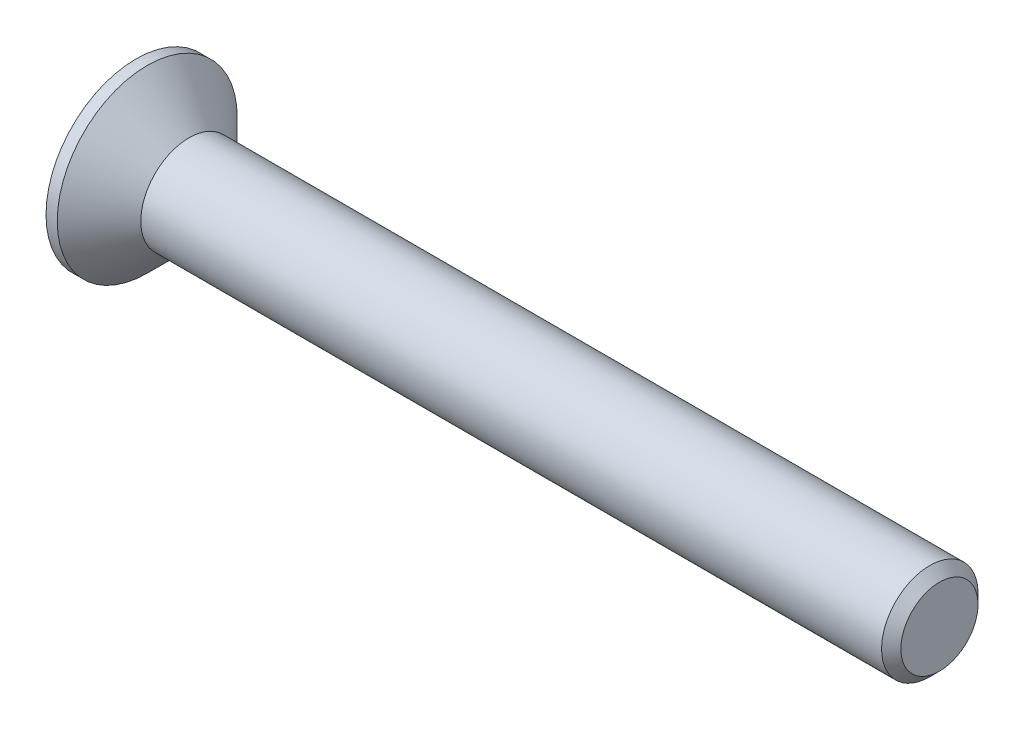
from build123d import *

# Parameters (mm, degrees)
CHAMFER1_SIZE      = 0.3
CUT_EXTRUDE1_DEPTH = 1.25


with BuildPart() as part:
    # Sketch1 → Revolve1 (revolve)
    with BuildSketch(Plane.XY, mode=Mode.PRIVATE) as revolve1_sk:
        Polygon((-1.65, 2.8), (-1.65, 0), (23.35, 0), (23.35, 1.5), (0, 1.5), (-1.3, 2.8), align=None)
    revolve(revolve1_sk.sketch.rotate(Axis((-1.65, 0, 0), (1, 0, 0)), 180), axis=Axis((-1.65, 0, 0), (1, 0, 0)))

    # Chamfer1
    chamfer1_edges = [part.edges().sort_by_distance(p)[0] for p in [
        (23.35, 1.5, 0),
    ]]
    chamfer(chamfer1_edges, length=CHAMFER1_SIZE)

    # Sketch2 → Cut-Extrude1 (cut)
    with BuildSketch(Plane.ZY.offset(1.65)):
        Polygon((-0.365, 1.45), (0.365, 1.45), (0.365, 0.365), (1.45, 0.365), (1.45, -0.365), (0.365, -0.365), (0.365, -1.45), (-0.365, -1.45), (-0.365, -0.365), (-1.45, -0.365), (-1.45, 0.365), (-0.365, 0.365), align=None)
    extrude(amount=-CUT_EXTRUDE1_DEPTH, mode=Mode.SUBTRACT)


solid = part.part
